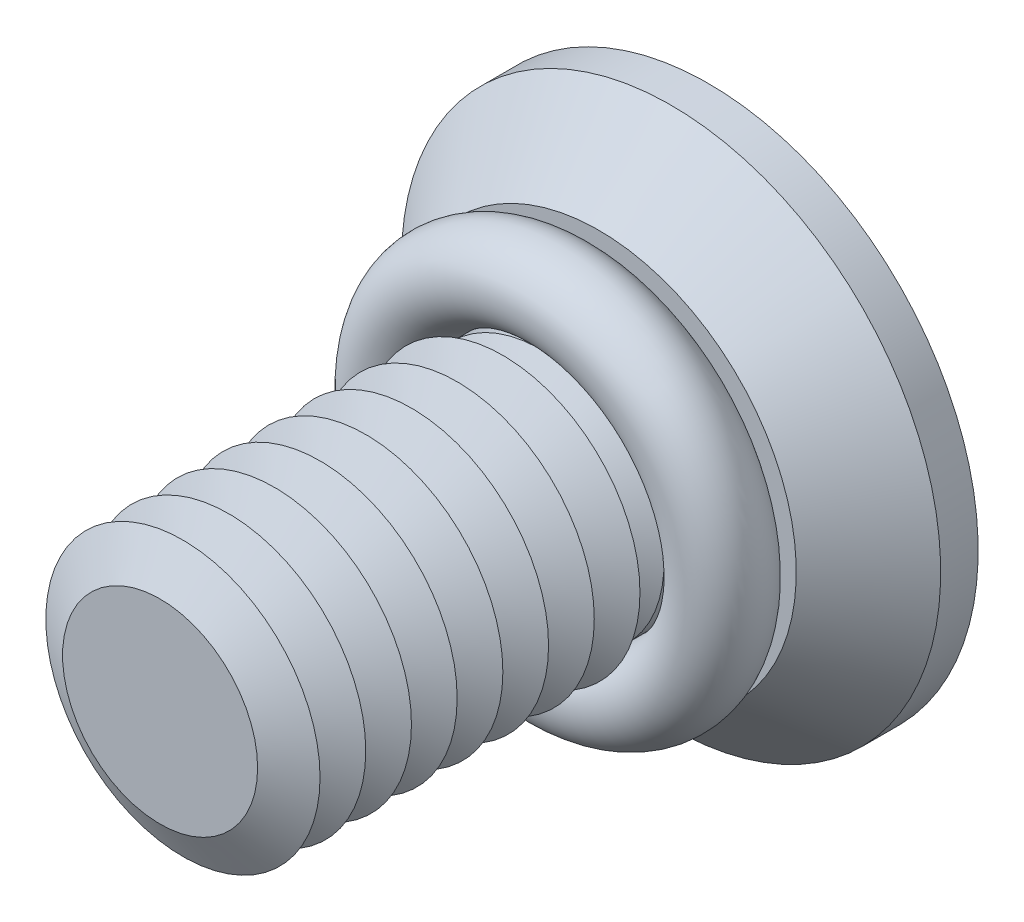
ISO-10303-21;
HEADER;
FILE_DESCRIPTION(('STEP AP214'),'2;1');
FILE_NAME('part.step','',(''),(''),'','','');
FILE_SCHEMA(('AUTOMOTIVE_DESIGN { 1 0 10303 214 1 1 1 1 }'));
ENDSEC;
DATA;
#1=APPLICATION_CONTEXT('core data for automotive mechanical design processes');
#2=APPLICATION_PROTOCOL_DEFINITION('international standard','automotive_design',2000,#1);
#3=PRODUCT_CONTEXT('',#1,'mechanical');
#4=PRODUCT('Part','Part','',(#3));
#5=PRODUCT_RELATED_PRODUCT_CATEGORY('part','',(#4));
#6=PRODUCT_DEFINITION_FORMATION('','',#4);
#7=PRODUCT_DEFINITION_CONTEXT('part definition',#1,'design');
#8=PRODUCT_DEFINITION('design','',#6,#7);
#9=PRODUCT_DEFINITION_SHAPE('','',#8);
#10=(LENGTH_UNIT() NAMED_UNIT(*) SI_UNIT(.MILLI.,.METRE.));
#11=(NAMED_UNIT(*) PLANE_ANGLE_UNIT() SI_UNIT($,.RADIAN.));
#12=(NAMED_UNIT(*) SI_UNIT($,.STERADIAN.) SOLID_ANGLE_UNIT());
#13=UNCERTAINTY_MEASURE_WITH_UNIT(LENGTH_MEASURE(1.E-05),#10,'distance_accuracy_value','');
#14=(GEOMETRIC_REPRESENTATION_CONTEXT(3) GLOBAL_UNCERTAINTY_ASSIGNED_CONTEXT((#13)) GLOBAL_UNIT_ASSIGNED_CONTEXT((#10,
#11,#12)) REPRESENTATION_CONTEXT('',''));
#15=CARTESIAN_POINT('',(0.,0.,0.));
#16=DIRECTION('',(0.,0.,1.));
#17=DIRECTION('',(1.,0.,0.));
#18=AXIS2_PLACEMENT_3D('',#15,#16,#17);
#19=CARTESIAN_POINT('',(0.,0.,3.30000000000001));
#20=DIRECTION('',(0.,0.,1.));
#21=DIRECTION('',(1.,0.,0.));
#22=AXIS2_PLACEMENT_3D('',#19,#20,#21);
#23=TOROIDAL_SURFACE('',#22,3.6,0.9);
#24=CARTESIAN_POINT('',(0.,3.6,3.30000000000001));
#25=DIRECTION('',(1.,0.,0.));
#26=DIRECTION('',(0.,0.,-1.));
#27=AXIS2_PLACEMENT_3D('',#24,#25,#26);
#28=CIRCLE('',#27,0.9);
#29=CARTESIAN_POINT('',(0.,4.5,3.30000000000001));
#30=VERTEX_POINT('',#29);
#31=EDGE_CURVE('P0_E10',#30,#30,#28,.T.);
#32=CARTESIAN_POINT('',(0.,0.,3.30000000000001));
#33=DIRECTION('',(0.,0.,1.));
#34=DIRECTION('',(1.,0.,0.));
#35=AXIS2_PLACEMENT_3D('',#32,#33,#34);
#36=CIRCLE('',#35,4.5);
#37=EDGE_CURVE('',#30,#30,#36,.T.);
#38=ORIENTED_EDGE('',*,*,#31,.F.);
#39=ORIENTED_EDGE('',*,*,#31,.T.);
#40=ORIENTED_EDGE('',*,*,#37,.T.);
#41=ORIENTED_EDGE('',*,*,#37,.F.);
#42=EDGE_LOOP('',(#38,#40,#39,#41));
#43=FACE_BOUND('',#42,.T.);
#44=ADVANCED_FACE('P0_F14',(#43),#23,.T.);
#45=CLOSED_SHELL('',(#44));
#46=MANIFOLD_SOLID_BREP('P0_B1',#45);
#47=CARTESIAN_POINT('',(0.,0.,7.));
#48=DIRECTION('',(0.,0.,-1.));
#49=DIRECTION('',(-1.,0.,0.));
#50=AXIS2_PLACEMENT_3D('',#47,#48,#49);
#51=CONICAL_SURFACE('',#50,2.13397459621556,1.0471975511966);
#52=CARTESIAN_POINT('',(0.,0.,6.5));
#53=DIRECTION('',(0.,0.,1.));
#54=DIRECTION('',(1.,0.,0.));
#55=AXIS2_PLACEMENT_3D('',#52,#53,#54);
#56=CIRCLE('',#55,3.);
#57=CARTESIAN_POINT('',(3.,0.,6.5));
#58=VERTEX_POINT('',#57);
#59=EDGE_CURVE('P1_E324',#58,#58,#56,.T.);
#60=ORIENTED_EDGE('',*,*,#59,.T.);
#61=EDGE_LOOP('',(#60));
#62=FACE_BOUND('',#61,.T.);
#63=CARTESIAN_POINT('',(0.,0.,7.));
#64=DIRECTION('',(0.,0.,1.));
#65=DIRECTION('',(1.,0.,0.));
#66=AXIS2_PLACEMENT_3D('',#63,#64,#65);
#67=CIRCLE('',#66,2.13397459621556);
#68=CARTESIAN_POINT('',(2.13397459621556,0.,7.));
#69=VERTEX_POINT('',#68);
#70=EDGE_CURVE('P1_E321',#69,#69,#67,.T.);
#71=ORIENTED_EDGE('',*,*,#70,.F.);
#72=EDGE_LOOP('',(#71));
#73=FACE_BOUND('',#72,.T.);
#74=ADVANCED_FACE('P1_F15',(#62,#73),#51,.T.);
#75=CARTESIAN_POINT('',(0.,0.,7.5));
#76=DIRECTION('',(0.,0.,1.));
#77=DIRECTION('',(1.,0.,0.));
#78=AXIS2_PLACEMENT_3D('',#75,#76,#77);
#79=CONICAL_SURFACE('',#78,3.,1.0471975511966);
#80=ORIENTED_EDGE('',*,*,#70,.T.);
#81=EDGE_LOOP('',(#80));
#82=FACE_BOUND('',#81,.T.);
#83=CARTESIAN_POINT('',(0.,0.,7.5));
#84=DIRECTION('',(0.,0.,1.));
#85=DIRECTION('',(1.,0.,0.));
#86=AXIS2_PLACEMENT_3D('',#83,#84,#85);
#87=CIRCLE('',#86,3.);
#88=CARTESIAN_POINT('',(3.,0.,7.5));
#89=VERTEX_POINT('',#88);
#90=EDGE_CURVE('P1_E318',#89,#89,#87,.T.);
#91=ORIENTED_EDGE('',*,*,#90,.F.);
#92=EDGE_LOOP('',(#91));
#93=FACE_BOUND('',#92,.T.);
#94=ADVANCED_FACE('P1_F245',(#82,#93),#79,.T.);
#95=CARTESIAN_POINT('',(0.,0.,12.));
#96=DIRECTION('',(0.,0.,1.));
#97=DIRECTION('',(1.,0.,0.));
#98=AXIS2_PLACEMENT_3D('',#95,#96,#97);
#99=PLANE('',#98);
#100=CARTESIAN_POINT('',(0.,0.,12.));
#101=DIRECTION('',(0.,0.,1.));
#102=DIRECTION('',(1.,0.,0.));
#103=AXIS2_PLACEMENT_3D('',#100,#101,#102);
#104=CIRCLE('',#103,2.13397459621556);
#105=CARTESIAN_POINT('',(2.13397459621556,0.,12.));
#106=VERTEX_POINT('',#105);
#107=EDGE_CURVE('P1_E131',#106,#106,#104,.T.);
#108=ORIENTED_EDGE('',*,*,#107,.T.);
#109=EDGE_LOOP('',(#108));
#110=FACE_BOUND('',#109,.T.);
#111=ADVANCED_FACE('P1_F251',(#110),#99,.T.);
#112=CARTESIAN_POINT('',(0.,0.,12.));
#113=DIRECTION('',(0.,0.,-1.));
#114=DIRECTION('',(-1.,0.,0.));
#115=AXIS2_PLACEMENT_3D('',#112,#113,#114);
#116=CONICAL_SURFACE('',#115,2.13397459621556,1.0471975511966);
#117=CARTESIAN_POINT('',(0.,0.,11.5));
#118=DIRECTION('',(0.,0.,1.));
#119=DIRECTION('',(1.,0.,0.));
#120=AXIS2_PLACEMENT_3D('',#117,#118,#119);
#121=CIRCLE('',#120,3.);
#122=CARTESIAN_POINT('',(3.,0.,11.5));
#123=VERTEX_POINT('',#122);
#124=EDGE_CURVE('P1_E133',#123,#123,#121,.T.);
#125=ORIENTED_EDGE('',*,*,#124,.T.);
#126=EDGE_LOOP('',(#125));
#127=FACE_BOUND('',#126,.T.);
#128=ORIENTED_EDGE('',*,*,#107,.F.);
#129=EDGE_LOOP('',(#128));
#130=FACE_BOUND('',#129,.T.);
#131=ADVANCED_FACE('P1_F196',(#127,#130),#116,.T.);
#132=CARTESIAN_POINT('',(0.,0.,11.5));
#133=DIRECTION('',(0.,0.,1.));
#134=DIRECTION('',(1.,0.,0.));
#135=AXIS2_PLACEMENT_3D('',#132,#133,#134);
#136=CONICAL_SURFACE('',#135,3.,1.0471975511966);
#137=CARTESIAN_POINT('',(0.,0.,11.));
#138=DIRECTION('',(0.,0.,1.));
#139=DIRECTION('',(1.,0.,0.));
#140=AXIS2_PLACEMENT_3D('',#137,#138,#139);
#141=CIRCLE('',#140,2.13397459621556);
#142=CARTESIAN_POINT('',(2.13397459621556,0.,11.));
#143=VERTEX_POINT('',#142);
#144=EDGE_CURVE('P1_E297',#143,#143,#141,.T.);
#145=ORIENTED_EDGE('',*,*,#144,.T.);
#146=EDGE_LOOP('',(#145));
#147=FACE_BOUND('',#146,.T.);
#148=ORIENTED_EDGE('',*,*,#124,.F.);
#149=EDGE_LOOP('',(#148));
#150=FACE_BOUND('',#149,.T.);
#151=ADVANCED_FACE('P1_F284',(#147,#150),#136,.T.);
#152=CARTESIAN_POINT('',(0.,0.,11.));
#153=DIRECTION('',(0.,0.,-1.));
#154=DIRECTION('',(-1.,0.,0.));
#155=AXIS2_PLACEMENT_3D('',#152,#153,#154);
#156=CONICAL_SURFACE('',#155,2.13397459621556,1.0471975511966);
#157=CARTESIAN_POINT('',(0.,0.,10.5));
#158=DIRECTION('',(0.,0.,1.));
#159=DIRECTION('',(1.,0.,0.));
#160=AXIS2_PLACEMENT_3D('',#157,#158,#159);
#161=CIRCLE('',#160,3.);
#162=CARTESIAN_POINT('',(3.,0.,10.5));
#163=VERTEX_POINT('',#162);
#164=EDGE_CURVE('P1_E294',#163,#163,#161,.T.);
#165=ORIENTED_EDGE('',*,*,#164,.T.);
#166=EDGE_LOOP('',(#165));
#167=FACE_BOUND('',#166,.T.);
#168=ORIENTED_EDGE('',*,*,#144,.F.);
#169=EDGE_LOOP('',(#168));
#170=FACE_BOUND('',#169,.T.);
#171=ADVANCED_FACE('P1_F279',(#167,#170),#156,.T.);
#172=CARTESIAN_POINT('',(0.,0.,10.5));
#173=DIRECTION('',(0.,0.,1.));
#174=DIRECTION('',(1.,0.,0.));
#175=AXIS2_PLACEMENT_3D('',#172,#173,#174);
#176=CONICAL_SURFACE('',#175,3.,1.0471975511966);
#177=CARTESIAN_POINT('',(0.,0.,10.));
#178=DIRECTION('',(0.,0.,1.));
#179=DIRECTION('',(1.,0.,0.));
#180=AXIS2_PLACEMENT_3D('',#177,#178,#179);
#181=CIRCLE('',#180,2.13397459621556);
#182=CARTESIAN_POINT('',(2.13397459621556,0.,10.));
#183=VERTEX_POINT('',#182);
#184=EDGE_CURVE('P1_E301',#183,#183,#181,.T.);
#185=ORIENTED_EDGE('',*,*,#184,.T.);
#186=EDGE_LOOP('',(#185));
#187=FACE_BOUND('',#186,.T.);
#188=ORIENTED_EDGE('',*,*,#164,.F.);
#189=EDGE_LOOP('',(#188));
#190=FACE_BOUND('',#189,.T.);
#191=ADVANCED_FACE('P1_F276',(#187,#190),#176,.T.);
#192=CARTESIAN_POINT('',(0.,0.,10.));
#193=DIRECTION('',(0.,0.,-1.));
#194=DIRECTION('',(-1.,0.,0.));
#195=AXIS2_PLACEMENT_3D('',#192,#193,#194);
#196=CONICAL_SURFACE('',#195,2.13397459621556,1.0471975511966);
#197=CARTESIAN_POINT('',(0.,0.,9.5));
#198=DIRECTION('',(0.,0.,1.));
#199=DIRECTION('',(1.,0.,0.));
#200=AXIS2_PLACEMENT_3D('',#197,#198,#199);
#201=CIRCLE('',#200,3.);
#202=CARTESIAN_POINT('',(3.,0.,9.5));
#203=VERTEX_POINT('',#202);
#204=EDGE_CURVE('P1_E306',#203,#203,#201,.T.);
#205=ORIENTED_EDGE('',*,*,#204,.T.);
#206=EDGE_LOOP('',(#205));
#207=FACE_BOUND('',#206,.T.);
#208=ORIENTED_EDGE('',*,*,#184,.F.);
#209=EDGE_LOOP('',(#208));
#210=FACE_BOUND('',#209,.T.);
#211=ADVANCED_FACE('P1_F271',(#207,#210),#196,.T.);
#212=CARTESIAN_POINT('',(0.,0.,9.5));
#213=DIRECTION('',(0.,0.,1.));
#214=DIRECTION('',(1.,0.,0.));
#215=AXIS2_PLACEMENT_3D('',#212,#213,#214);
#216=CONICAL_SURFACE('',#215,3.,1.0471975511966);
#217=CARTESIAN_POINT('',(0.,0.,9.));
#218=DIRECTION('',(0.,0.,1.));
#219=DIRECTION('',(1.,0.,0.));
#220=AXIS2_PLACEMENT_3D('',#217,#218,#219);
#221=CIRCLE('',#220,2.13397459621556);
#222=CARTESIAN_POINT('',(2.13397459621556,0.,9.));
#223=VERTEX_POINT('',#222);
#224=EDGE_CURVE('P1_E309',#223,#223,#221,.T.);
#225=ORIENTED_EDGE('',*,*,#224,.T.);
#226=EDGE_LOOP('',(#225));
#227=FACE_BOUND('',#226,.T.);
#228=ORIENTED_EDGE('',*,*,#204,.F.);
#229=EDGE_LOOP('',(#228));
#230=FACE_BOUND('',#229,.T.);
#231=ADVANCED_FACE('P1_F268',(#227,#230),#216,.T.);
#232=CARTESIAN_POINT('',(0.,0.,9.));
#233=DIRECTION('',(0.,0.,-1.));
#234=DIRECTION('',(-1.,0.,0.));
#235=AXIS2_PLACEMENT_3D('',#232,#233,#234);
#236=CONICAL_SURFACE('',#235,2.13397459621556,1.0471975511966);
#237=CARTESIAN_POINT('',(0.,0.,8.5));
#238=DIRECTION('',(0.,0.,1.));
#239=DIRECTION('',(1.,0.,0.));
#240=AXIS2_PLACEMENT_3D('',#237,#238,#239);
#241=CIRCLE('',#240,3.);
#242=CARTESIAN_POINT('',(3.,0.,8.5));
#243=VERTEX_POINT('',#242);
#244=EDGE_CURVE('P1_E312',#243,#243,#241,.T.);
#245=ORIENTED_EDGE('',*,*,#244,.T.);
#246=EDGE_LOOP('',(#245));
#247=FACE_BOUND('',#246,.T.);
#248=ORIENTED_EDGE('',*,*,#224,.F.);
#249=EDGE_LOOP('',(#248));
#250=FACE_BOUND('',#249,.T.);
#251=ADVANCED_FACE('P1_F262',(#247,#250),#236,.T.);
#252=CARTESIAN_POINT('',(0.,0.,8.5));
#253=DIRECTION('',(0.,0.,1.));
#254=DIRECTION('',(1.,0.,0.));
#255=AXIS2_PLACEMENT_3D('',#252,#253,#254);
#256=CONICAL_SURFACE('',#255,3.,1.0471975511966);
#257=CARTESIAN_POINT('',(0.,0.,8.));
#258=DIRECTION('',(0.,0.,1.));
#259=DIRECTION('',(1.,0.,0.));
#260=AXIS2_PLACEMENT_3D('',#257,#258,#259);
#261=CIRCLE('',#260,2.13397459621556);
#262=CARTESIAN_POINT('',(2.13397459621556,0.,8.));
#263=VERTEX_POINT('',#262);
#264=EDGE_CURVE('P1_E315',#263,#263,#261,.T.);
#265=ORIENTED_EDGE('',*,*,#264,.T.);
#266=EDGE_LOOP('',(#265));
#267=FACE_BOUND('',#266,.T.);
#268=ORIENTED_EDGE('',*,*,#244,.F.);
#269=EDGE_LOOP('',(#268));
#270=FACE_BOUND('',#269,.T.);
#271=ADVANCED_FACE('P1_F258',(#267,#270),#256,.T.);
#272=CARTESIAN_POINT('',(0.,0.,8.));
#273=DIRECTION('',(0.,0.,-1.));
#274=DIRECTION('',(-1.,0.,0.));
#275=AXIS2_PLACEMENT_3D('',#272,#273,#274);
#276=CONICAL_SURFACE('',#275,2.13397459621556,1.0471975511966);
#277=ORIENTED_EDGE('',*,*,#90,.T.);
#278=EDGE_LOOP('',(#277));
#279=FACE_BOUND('',#278,.T.);
#280=ORIENTED_EDGE('',*,*,#264,.F.);
#281=EDGE_LOOP('',(#280));
#282=FACE_BOUND('',#281,.T.);
#283=ADVANCED_FACE('P1_F261',(#279,#282),#276,.T.);
#284=CARTESIAN_POINT('',(0.,0.,6.));
#285=DIRECTION('',(0.,0.,-1.));
#286=DIRECTION('',(-1.,0.,0.));
#287=AXIS2_PLACEMENT_3D('',#284,#285,#286);
#288=CONICAL_SURFACE('',#287,2.13397459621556,1.0471975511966);
#289=CARTESIAN_POINT('',(0.,0.,5.5));
#290=DIRECTION('',(0.,0.,1.));
#291=DIRECTION('',(1.,0.,0.));
#292=AXIS2_PLACEMENT_3D('',#289,#290,#291);
#293=CIRCLE('',#292,3.);
#294=CARTESIAN_POINT('',(3.,0.,5.5));
#295=VERTEX_POINT('',#294);
#296=EDGE_CURVE('P1_E329',#295,#295,#293,.T.);
#297=ORIENTED_EDGE('',*,*,#296,.T.);
#298=EDGE_LOOP('',(#297));
#299=FACE_BOUND('',#298,.T.);
#300=CARTESIAN_POINT('',(0.,0.,6.));
#301=DIRECTION('',(0.,0.,1.));
#302=DIRECTION('',(1.,0.,0.));
#303=AXIS2_PLACEMENT_3D('',#300,#301,#302);
#304=CIRCLE('',#303,2.13397459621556);
#305=CARTESIAN_POINT('',(2.13397459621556,0.,6.));
#306=VERTEX_POINT('',#305);
#307=EDGE_CURVE('P1_E326',#306,#306,#304,.T.);
#308=ORIENTED_EDGE('',*,*,#307,.F.);
#309=EDGE_LOOP('',(#308));
#310=FACE_BOUND('',#309,.T.);
#311=ADVANCED_FACE('P1_F266',(#299,#310),#288,.T.);
#312=CARTESIAN_POINT('',(0.,0.,6.5));
#313=DIRECTION('',(0.,0.,1.));
#314=DIRECTION('',(1.,0.,0.));
#315=AXIS2_PLACEMENT_3D('',#312,#313,#314);
#316=CONICAL_SURFACE('',#315,3.,1.0471975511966);
#317=ORIENTED_EDGE('',*,*,#307,.T.);
#318=EDGE_LOOP('',(#317));
#319=FACE_BOUND('',#318,.T.);
#320=ORIENTED_EDGE('',*,*,#59,.F.);
#321=EDGE_LOOP('',(#320));
#322=FACE_BOUND('',#321,.T.);
#323=ADVANCED_FACE('P1_F444',(#319,#322),#316,.T.);
#324=CARTESIAN_POINT('',(0.,0.,5.));
#325=DIRECTION('',(0.,0.,-1.));
#326=DIRECTION('',(-1.,0.,0.));
#327=AXIS2_PLACEMENT_3D('',#324,#325,#326);
#328=CONICAL_SURFACE('',#327,2.13397459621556,1.0471975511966);
#329=CARTESIAN_POINT('',(0.,0.,4.5));
#330=DIRECTION('',(0.,0.,1.));
#331=DIRECTION('',(1.,0.,0.));
#332=AXIS2_PLACEMENT_3D('',#329,#330,#331);
#333=CIRCLE('',#332,3.);
#334=CARTESIAN_POINT('',(3.,0.,4.5));
#335=VERTEX_POINT('',#334);
#336=EDGE_CURVE('P1_E335',#335,#335,#333,.T.);
#337=ORIENTED_EDGE('',*,*,#336,.T.);
#338=EDGE_LOOP('',(#337));
#339=FACE_BOUND('',#338,.T.);
#340=CARTESIAN_POINT('',(0.,0.,5.));
#341=DIRECTION('',(0.,0.,1.));
#342=DIRECTION('',(1.,0.,0.));
#343=AXIS2_PLACEMENT_3D('',#340,#341,#342);
#344=CIRCLE('',#343,2.13397459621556);
#345=CARTESIAN_POINT('',(2.13397459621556,0.,5.));
#346=VERTEX_POINT('',#345);
#347=EDGE_CURVE('P1_E332',#346,#346,#344,.T.);
#348=ORIENTED_EDGE('',*,*,#347,.F.);
#349=EDGE_LOOP('',(#348));
#350=FACE_BOUND('',#349,.T.);
#351=ADVANCED_FACE('P1_F454',(#339,#350),#328,.T.);
#352=CARTESIAN_POINT('',(0.,0.,5.5));
#353=DIRECTION('',(0.,0.,1.));
#354=DIRECTION('',(1.,0.,0.));
#355=AXIS2_PLACEMENT_3D('',#352,#353,#354);
#356=CONICAL_SURFACE('',#355,3.,1.0471975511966);
#357=ORIENTED_EDGE('',*,*,#347,.T.);
#358=EDGE_LOOP('',(#357));
#359=FACE_BOUND('',#358,.T.);
#360=ORIENTED_EDGE('',*,*,#296,.F.);
#361=EDGE_LOOP('',(#360));
#362=FACE_BOUND('',#361,.T.);
#363=ADVANCED_FACE('P1_F348',(#359,#362),#356,.T.);
#364=CARTESIAN_POINT('',(0.,0.,4.));
#365=DIRECTION('',(0.,0.,-1.));
#366=DIRECTION('',(-1.,0.,0.));
#367=AXIS2_PLACEMENT_3D('',#364,#365,#366);
#368=CONICAL_SURFACE('',#367,2.13397459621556,1.0471975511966);
#369=CARTESIAN_POINT('',(0.,0.,4.));
#370=DIRECTION('',(0.,0.,1.));
#371=DIRECTION('',(1.,0.,0.));
#372=AXIS2_PLACEMENT_3D('',#369,#370,#371);
#373=CIRCLE('',#372,2.13397459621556);
#374=CARTESIAN_POINT('',(2.13397459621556,0.,4.));
#375=VERTEX_POINT('',#374);
#376=EDGE_CURVE('P1_E338',#375,#375,#373,.T.);
#377=ORIENTED_EDGE('',*,*,#376,.F.);
#378=EDGE_LOOP('',(#377));
#379=FACE_BOUND('',#378,.T.);
#380=CARTESIAN_POINT('',(0.,0.,3.67320508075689));
#381=DIRECTION('',(0.,0.,-1.));
#382=DIRECTION('',(-1.,0.,0.));
#383=AXIS2_PLACEMENT_3D('',#380,#381,#382);
#384=CIRCLE('',#383,2.7);
#385=CARTESIAN_POINT('',(-2.7,0.,3.67320508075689));
#386=VERTEX_POINT('',#385);
#387=EDGE_CURVE('P1_E19',#386,#386,#384,.F.);
#388=ORIENTED_EDGE('',*,*,#387,.T.);
#389=EDGE_LOOP('',(#388));
#390=FACE_BOUND('',#389,.T.);
#391=ADVANCED_FACE('P1_F345',(#379,#390),#368,.T.);
#392=CARTESIAN_POINT('',(0.,0.,4.5));
#393=DIRECTION('',(0.,0.,1.));
#394=DIRECTION('',(1.,0.,0.));
#395=AXIS2_PLACEMENT_3D('',#392,#393,#394);
#396=CONICAL_SURFACE('',#395,3.,1.0471975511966);
#397=ORIENTED_EDGE('',*,*,#376,.T.);
#398=EDGE_LOOP('',(#397));
#399=FACE_BOUND('',#398,.T.);
#400=ORIENTED_EDGE('',*,*,#336,.F.);
#401=EDGE_LOOP('',(#400));
#402=FACE_BOUND('',#401,.T.);
#403=ADVANCED_FACE('P1_F342',(#399,#402),#396,.T.);
#404=CARTESIAN_POINT('',(0.,0.,2.5));
#405=DIRECTION('',(0.,0.,-1.));
#406=DIRECTION('',(-1.,0.,0.));
#407=AXIS2_PLACEMENT_3D('',#404,#405,#406);
#408=CONICAL_SURFACE('',#407,2.,1.0471975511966);
#409=CARTESIAN_POINT('',(0.,0.,3.65470053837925));
#410=VERTEX_POINT('',#409);
#411=VERTEX_LOOP('',#410);
#412=FACE_BOUND('',#411,.T.);
#413=CARTESIAN_POINT('',(0.,0.,2.5));
#414=DIRECTION('',(0.,0.,-1.));
#415=DIRECTION('',(-1.,0.,0.));
#416=AXIS2_PLACEMENT_3D('',#413,#414,#415);
#417=CIRCLE('',#416,2.);
#418=CARTESIAN_POINT('',(-2.,0.,2.5));
#419=VERTEX_POINT('',#418);
#420=CARTESIAN_POINT('',(-1.,1.73205080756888,2.5));
#421=VERTEX_POINT('',#420);
#422=EDGE_CURVE('P1_E117',#419,#421,#417,.T.);
#423=ORIENTED_EDGE('',*,*,#422,.T.);
#424=CARTESIAN_POINT('',(0.,0.,2.5));
#425=DIRECTION('',(0.,0.,-1.));
#426=DIRECTION('',(-1.,0.,0.));
#427=AXIS2_PLACEMENT_3D('',#424,#425,#426);
#428=CIRCLE('',#427,2.);
#429=CARTESIAN_POINT('',(1.,1.73205080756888,2.5));
#430=VERTEX_POINT('',#429);
#431=EDGE_CURVE('P1_E24',#421,#430,#428,.T.);
#432=ORIENTED_EDGE('',*,*,#431,.T.);
#433=CARTESIAN_POINT('',(2.,0.,2.5));
#434=VERTEX_POINT('',#433);
#435=EDGE_CURVE('P1_E687',#430,#434,#428,.T.);
#436=ORIENTED_EDGE('',*,*,#435,.T.);
#437=CARTESIAN_POINT('',(1.,-1.73205080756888,2.5));
#438=VERTEX_POINT('',#437);
#439=EDGE_CURVE('P1_E680',#434,#438,#428,.T.);
#440=ORIENTED_EDGE('',*,*,#439,.T.);
#441=CARTESIAN_POINT('',(-1.,-1.73205080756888,2.5));
#442=VERTEX_POINT('',#441);
#443=EDGE_CURVE('P1_E182',#438,#442,#428,.T.);
#444=ORIENTED_EDGE('',*,*,#443,.T.);
#445=EDGE_CURVE('P1_E179',#442,#419,#428,.T.);
#446=ORIENTED_EDGE('',*,*,#445,.T.);
#447=EDGE_LOOP('',(#423,#432,#436,#440,#444,#446));
#448=FACE_BOUND('',#447,.T.);
#449=ADVANCED_FACE('P1_F198',(#412,#448),#408,.F.);
#450=CARTESIAN_POINT('',(0.,0.,2.5));
#451=DIRECTION('',(0.,0.,-1.));
#452=DIRECTION('',(-1.,0.,0.));
#453=AXIS2_PLACEMENT_3D('',#450,#451,#452);
#454=PLANE('',#453);
#455=ORIENTED_EDGE('',*,*,#443,.F.);
#456=DIRECTION('',(-0.866025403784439,-0.5,0.));
#457=VECTOR('',#456,1.);
#458=CARTESIAN_POINT('',(2.,-1.15470053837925,2.5));
#459=LINE('',#458,#457);
#460=CARTESIAN_POINT('',(0.,-2.3094010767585,2.5));
#461=VERTEX_POINT('',#460);
#462=EDGE_CURVE('P1_E696',#438,#461,#459,.T.);
#463=ORIENTED_EDGE('',*,*,#462,.T.);
#464=DIRECTION('',(-0.866025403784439,0.5,0.));
#465=VECTOR('',#464,1.);
#466=CARTESIAN_POINT('',(0.,-2.3094010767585,2.5));
#467=LINE('',#466,#465);
#468=EDGE_CURVE('P1_E703',#461,#442,#467,.T.);
#469=ORIENTED_EDGE('',*,*,#468,.T.);
#470=EDGE_LOOP('',(#455,#463,#469));
#471=FACE_BOUND('',#470,.T.);
#472=ADVANCED_FACE('P1_F496',(#471),#454,.T.);
#473=ORIENTED_EDGE('',*,*,#445,.F.);
#474=CARTESIAN_POINT('',(-2.,-1.15470053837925,2.5));
#475=VERTEX_POINT('',#474);
#476=EDGE_CURVE('P1_E706',#442,#475,#467,.T.);
#477=ORIENTED_EDGE('',*,*,#476,.T.);
#478=DIRECTION('',(0.,1.,0.));
#479=VECTOR('',#478,1.);
#480=CARTESIAN_POINT('',(-2.,-1.15470053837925,2.5));
#481=LINE('',#480,#479);
#482=EDGE_CURVE('P1_E123',#475,#419,#481,.T.);
#483=ORIENTED_EDGE('',*,*,#482,.T.);
#484=EDGE_LOOP('',(#473,#477,#483));
#485=FACE_BOUND('',#484,.T.);
#486=ADVANCED_FACE('P1_F231',(#485),#454,.T.);
#487=ORIENTED_EDGE('',*,*,#422,.F.);
#488=CARTESIAN_POINT('',(-2.,1.15470053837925,2.5));
#489=VERTEX_POINT('',#488);
#490=EDGE_CURVE('P1_E708',#419,#489,#481,.T.);
#491=ORIENTED_EDGE('',*,*,#490,.T.);
#492=DIRECTION('',(0.866025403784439,0.5,0.));
#493=VECTOR('',#492,1.);
#494=CARTESIAN_POINT('',(-2.,1.15470053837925,2.5));
#495=LINE('',#494,#493);
#496=EDGE_CURVE('P1_E711',#489,#421,#495,.T.);
#497=ORIENTED_EDGE('',*,*,#496,.T.);
#498=EDGE_LOOP('',(#487,#491,#497));
#499=FACE_BOUND('',#498,.T.);
#500=ADVANCED_FACE('P1_F514',(#499),#454,.T.);
#501=ORIENTED_EDGE('',*,*,#431,.F.);
#502=CARTESIAN_POINT('',(0.,2.3094010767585,2.5));
#503=VERTEX_POINT('',#502);
#504=EDGE_CURVE('P1_E710',#421,#503,#495,.T.);
#505=ORIENTED_EDGE('',*,*,#504,.T.);
#506=DIRECTION('',(0.866025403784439,-0.5,0.));
#507=VECTOR('',#506,1.);
#508=CARTESIAN_POINT('',(0.,2.3094010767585,2.5));
#509=LINE('',#508,#507);
#510=EDGE_CURVE('P1_E161',#503,#430,#509,.T.);
#511=ORIENTED_EDGE('',*,*,#510,.T.);
#512=EDGE_LOOP('',(#501,#505,#511));
#513=FACE_BOUND('',#512,.T.);
#514=ADVANCED_FACE('P1_F523',(#513),#454,.T.);
#515=ORIENTED_EDGE('',*,*,#435,.F.);
#516=CARTESIAN_POINT('',(2.,1.15470053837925,2.5));
#517=VERTEX_POINT('',#516);
#518=EDGE_CURVE('P1_E695',#430,#517,#509,.T.);
#519=ORIENTED_EDGE('',*,*,#518,.T.);
#520=DIRECTION('',(0.,-1.,0.));
#521=VECTOR('',#520,1.);
#522=CARTESIAN_POINT('',(2.,1.15470053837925,2.5));
#523=LINE('',#522,#521);
#524=EDGE_CURVE('P1_E690',#517,#434,#523,.T.);
#525=ORIENTED_EDGE('',*,*,#524,.T.);
#526=EDGE_LOOP('',(#515,#519,#525));
#527=FACE_BOUND('',#526,.T.);
#528=ADVANCED_FACE('P1_F533',(#527),#454,.T.);
#529=ORIENTED_EDGE('',*,*,#439,.F.);
#530=CARTESIAN_POINT('',(2.,-1.15470053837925,2.5));
#531=VERTEX_POINT('',#530);
#532=EDGE_CURVE('P1_E682',#434,#531,#523,.T.);
#533=ORIENTED_EDGE('',*,*,#532,.T.);
#534=EDGE_CURVE('P1_E125',#531,#438,#459,.T.);
#535=ORIENTED_EDGE('',*,*,#534,.T.);
#536=EDGE_LOOP('',(#529,#533,#535));
#537=FACE_BOUND('',#536,.T.);
#538=ADVANCED_FACE('P1_F229',(#537),#454,.T.);
#539=CARTESIAN_POINT('',(2.,-1.15470053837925,2.5));
#540=DIRECTION('',(0.5,-0.866025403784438,0.));
#541=DIRECTION('',(0.866025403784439,0.5,0.));
#542=AXIS2_PLACEMENT_3D('',#539,#540,#541);
#543=PLANE('',#542);
#544=DIRECTION('',(0.,0.,-1.));
#545=VECTOR('',#544,1.);
#546=CARTESIAN_POINT('',(2.,-1.15470053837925,2.5));
#547=LINE('',#546,#545);
#548=CARTESIAN_POINT('',(2.,-1.15470053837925,0.));
#549=VERTEX_POINT('',#548);
#550=EDGE_CURVE('P1_E164',#531,#549,#547,.T.);
#551=ORIENTED_EDGE('',*,*,#550,.T.);
#552=CARTESIAN_POINT('',(2.0002,-1.15458506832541,-3.09424280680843E-05));
#553=CARTESIAN_POINT('',(1.91712847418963,-1.20254643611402,0.0128270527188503));
#554=CARTESIAN_POINT('',(1.83390630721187,-1.25059477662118,0.0245000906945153));
#555=CARTESIAN_POINT('',(1.66716800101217,-1.3468611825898,0.0450086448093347));
#556=CARTESIAN_POINT('',(1.58365175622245,-1.39507930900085,0.0538430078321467));
#557=CARTESIAN_POINT('',(1.41683177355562,-1.49139287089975,0.0681583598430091));
#558=CARTESIAN_POINT('',(1.33352916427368,-1.53948765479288,0.0736564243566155));
#559=CARTESIAN_POINT('',(1.1668176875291,-1.63573857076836,0.0810287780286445));
#560=CARTESIAN_POINT('',(1.08340884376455,-1.68389468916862,0.0829037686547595));
#561=CARTESIAN_POINT('',(0.916591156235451,-1.78020692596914,0.0829037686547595));
#562=CARTESIAN_POINT('',(0.833182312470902,-1.82836304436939,0.0810287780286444));
#563=CARTESIAN_POINT('',(0.666470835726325,-1.92461396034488,0.0736564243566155));
#564=CARTESIAN_POINT('',(0.583168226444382,-1.972708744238,0.068158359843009));
#565=CARTESIAN_POINT('',(0.416348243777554,-2.06902230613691,0.0538430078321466));
#566=CARTESIAN_POINT('',(0.332831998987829,-2.11724043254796,0.0450086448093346));
#567=CARTESIAN_POINT('',(0.16609369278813,-2.21350683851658,0.0245000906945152));
#568=CARTESIAN_POINT('',(0.0828715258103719,-2.26155517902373,0.0128270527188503));
#569=CARTESIAN_POINT('',(-0.000199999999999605,-2.30951654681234,-3.09424280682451E-05));
#570=B_SPLINE_CURVE_WITH_KNOTS('',3,(#552,#553,#554,#555,#556,#557,#558,#559,#560,#561,#562,
#563,#564,#565,#566,#567,#568,#569),.UNSPECIFIED.,.F.,.F.,(4,2,2,2,2,2,2,2,4),(0.,
0.290357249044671,0.580832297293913,0.869807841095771,1.15872743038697,1.44764701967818,
1.73662256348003,2.02709761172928,2.31745486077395),.UNSPECIFIED.);
#571=CARTESIAN_POINT('',(0.,-2.3094010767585,0.));
#572=VERTEX_POINT('',#571);
#573=EDGE_CURVE('P1_E118',#549,#572,#570,.T.);
#574=ORIENTED_EDGE('',*,*,#573,.T.);
#575=DIRECTION('',(0.,0.,-1.));
#576=VECTOR('',#575,1.);
#577=CARTESIAN_POINT('',(0.,-2.3094010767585,2.5));
#578=LINE('',#577,#576);
#579=EDGE_CURVE('P1_E116',#461,#572,#578,.T.);
#580=ORIENTED_EDGE('',*,*,#579,.F.);
#581=ORIENTED_EDGE('',*,*,#462,.F.);
#582=ORIENTED_EDGE('',*,*,#534,.F.);
#583=EDGE_LOOP('',(#551,#574,#580,#581,#582));
#584=FACE_BOUND('',#583,.T.);
#585=ADVANCED_FACE('P1_F226',(#584),#543,.F.);
#586=CARTESIAN_POINT('',(0.,-2.3094010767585,2.5));
#587=DIRECTION('',(-0.5,-0.866025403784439,0.));
#588=DIRECTION('',(0.866025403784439,-0.5,0.));
#589=AXIS2_PLACEMENT_3D('',#586,#587,#588);
#590=PLANE('',#589);
#591=ORIENTED_EDGE('',*,*,#579,.T.);
#592=CARTESIAN_POINT('',(0.000200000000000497,-2.30951654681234,-3.09424280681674E-05));
#593=CARTESIAN_POINT('',(-0.0828715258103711,-2.26155517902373,0.0128270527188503));
#594=CARTESIAN_POINT('',(-0.166093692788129,-2.21350683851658,0.0245000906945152));
#595=CARTESIAN_POINT('',(-0.332831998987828,-2.11724043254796,0.0450086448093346));
#596=CARTESIAN_POINT('',(-0.416348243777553,-2.06902230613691,0.0538430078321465));
#597=CARTESIAN_POINT('',(-0.583168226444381,-1.972708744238,0.068158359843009));
#598=CARTESIAN_POINT('',(-0.666470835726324,-1.92461396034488,0.0736564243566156));
#599=CARTESIAN_POINT('',(-0.833182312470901,-1.82836304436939,0.0810287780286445));
#600=CARTESIAN_POINT('',(-0.916591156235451,-1.78020692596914,0.0829037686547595));
#601=CARTESIAN_POINT('',(-1.08340884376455,-1.68389468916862,0.0829037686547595));
#602=CARTESIAN_POINT('',(-1.1668176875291,-1.63573857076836,0.0810287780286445));
#603=CARTESIAN_POINT('',(-1.33352916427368,-1.53948765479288,0.0736564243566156));
#604=CARTESIAN_POINT('',(-1.41683177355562,-1.49139287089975,0.0681583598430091));
#605=CARTESIAN_POINT('',(-1.58365175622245,-1.39507930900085,0.0538430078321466));
#606=CARTESIAN_POINT('',(-1.66716800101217,-1.3468611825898,0.0450086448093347));
#607=CARTESIAN_POINT('',(-1.83390630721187,-1.25059477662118,0.0245000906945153));
#608=CARTESIAN_POINT('',(-1.91712847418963,-1.20254643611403,0.0128270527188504));
#609=CARTESIAN_POINT('',(-2.0002,-1.15458506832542,-3.09424280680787E-05));
#610=B_SPLINE_CURVE_WITH_KNOTS('',3,(#592,#593,#594,#595,#596,#597,#598,#599,#600,#601,#602,
#603,#604,#605,#606,#607,#608,#609),.UNSPECIFIED.,.F.,.F.,(4,2,2,2,2,2,2,2,4),(0.,
0.29035724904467,0.580832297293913,0.869807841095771,1.15872743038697,1.44764701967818,
1.73662256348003,2.02709761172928,2.31745486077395),.UNSPECIFIED.);
#611=CARTESIAN_POINT('',(-2.,-1.15470053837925,0.));
#612=VERTEX_POINT('',#611);
#613=EDGE_CURVE('P1_E94',#572,#612,#610,.T.);
#614=ORIENTED_EDGE('',*,*,#613,.T.);
#615=DIRECTION('',(0.,0.,-1.));
#616=VECTOR('',#615,1.);
#617=CARTESIAN_POINT('',(-2.,-1.15470053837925,2.5));
#618=LINE('',#617,#616);
#619=EDGE_CURVE('P1_E112',#475,#612,#618,.T.);
#620=ORIENTED_EDGE('',*,*,#619,.F.);
#621=ORIENTED_EDGE('',*,*,#476,.F.);
#622=ORIENTED_EDGE('',*,*,#468,.F.);
#623=EDGE_LOOP('',(#591,#614,#620,#621,#622));
#624=FACE_BOUND('',#623,.T.);
#625=ADVANCED_FACE('P1_F110',(#624),#590,.F.);
#626=CARTESIAN_POINT('',(-2.,-1.15470053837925,2.5));
#627=DIRECTION('',(-1.,0.,0.));
#628=DIRECTION('',(0.,-1.,0.));
#629=AXIS2_PLACEMENT_3D('',#626,#627,#628);
#630=PLANE('',#629);
#631=ORIENTED_EDGE('',*,*,#619,.T.);
#632=CARTESIAN_POINT('',(-2.,-3.01440758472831,-0.350516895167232));
#633=CARTESIAN_POINT('',(-2.,-2.92409762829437,-0.330356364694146));
#634=CARTESIAN_POINT('',(-2.,-2.83373054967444,-0.310452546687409));
#635=CARTESIAN_POINT('',(-2.,-2.65285291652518,-0.271288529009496));
#636=CARTESIAN_POINT('',(-2.,-2.56234235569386,-0.252028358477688));
#637=CARTESIAN_POINT('',(-2.,-2.29037985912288,-0.195373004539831));
#638=CARTESIAN_POINT('',(-2.,-2.10868043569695,-0.159144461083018));
#639=CARTESIAN_POINT('',(-2.,-1.74597297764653,-0.0917168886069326));
#640=CARTESIAN_POINT('',(-2.,-1.5649726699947,-0.0604768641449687));
#641=CARTESIAN_POINT('',(-2.,-1.20186568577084,-0.00513826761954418));
#642=CARTESIAN_POINT('',(-2.,-1.01975924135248,0.0189617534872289));
#643=CARTESIAN_POINT('',(-2.,-0.744747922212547,0.0474098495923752));
#644=CARTESIAN_POINT('',(-2.,-0.652245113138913,0.0556328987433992));
#645=CARTESIAN_POINT('',(-2.,-0.467020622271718,0.0690059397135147));
#646=CARTESIAN_POINT('',(-2.,-0.374298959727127,0.0741561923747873));
#647=CARTESIAN_POINT('',(-2.,-0.188764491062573,0.081084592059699));
#648=CARTESIAN_POINT('',(-2.,-0.0959517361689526,0.082864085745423));
#649=CARTESIAN_POINT('',(-2.,0.0896753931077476,0.0829421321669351));
#650=CARTESIAN_POINT('',(-2.,0.182489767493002,0.0812406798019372));
#651=CARTESIAN_POINT('',(-2.,0.368369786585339,0.074451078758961));
#652=CARTESIAN_POINT('',(-2.,0.461434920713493,0.0693492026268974));
#653=CARTESIAN_POINT('',(-2.,0.647346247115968,0.0560433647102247));
#654=CARTESIAN_POINT('',(-2.,0.7401924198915,0.0478391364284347));
#655=CARTESIAN_POINT('',(-2.,1.01841374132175,0.0191822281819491));
#656=CARTESIAN_POINT('',(-2.,1.20337134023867,-0.00531018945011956));
#657=CARTESIAN_POINT('',(-2.,1.5769439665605,-0.0623620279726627));
#658=CARTESIAN_POINT('',(-2.,1.76552771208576,-0.0951161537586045));
#659=CARTESIAN_POINT('',(-2.,2.14178491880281,-0.165570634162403));
#660=CARTESIAN_POINT('',(-2.,2.32945822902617,-0.203271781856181));
#661=CARTESIAN_POINT('',(-2.,2.70417911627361,-0.281883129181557));
#662=CARTESIAN_POINT('',(-2.,2.89122649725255,-0.322794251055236));
#663=CARTESIAN_POINT('',(-2.,3.264844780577,-0.406742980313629));
#664=CARTESIAN_POINT('',(-2.,3.45141567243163,-0.449780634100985));
#665=CARTESIAN_POINT('',(-2.,3.82193813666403,-0.536781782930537));
#666=CARTESIAN_POINT('',(-2.,4.00589388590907,-0.580727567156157));
#667=CARTESIAN_POINT('',(-2.,4.37356350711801,-0.669635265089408));
#668=CARTESIAN_POINT('',(-2.,4.55727737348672,-0.714597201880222));
#669=CARTESIAN_POINT('',(-2.,4.9242660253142,-0.805198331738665));
#670=CARTESIAN_POINT('',(-2.,5.10754106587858,-0.850836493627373));
#671=CARTESIAN_POINT('',(-2.,5.47394280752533,-0.942676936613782));
#672=CARTESIAN_POINT('',(-2.,5.65706951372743,-0.988879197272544));
#673=CARTESIAN_POINT('',(-2.,5.8401458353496,-1.03527803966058));
#674=B_SPLINE_CURVE_WITH_KNOTS('',3,(#632,#633,#634,#635,#636,#637,#638,#639,#640,#641,#642,
#643,#644,#645,#646,#647,#648,#649,#650,#651,#652,#653,#654,#655,#656,#657,#658,#659,#660,#661,
#662,#663,#664,#665,#666,#667,#668,#669,#670,#671,#672,#673),.UNSPECIFIED.,.F.,.F.,(4,2,2,2,2,2,
2,2,2,2,2,2,2,2,2,2,2,2,2,2,4),(0.,0.277597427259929,0.555207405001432,1.11099118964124,
1.6619420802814,2.21278108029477,2.49134108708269,2.76987744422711,3.04830249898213,
3.32672796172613,3.60628428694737,3.88586463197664,4.4453261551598,5.01945893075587,
5.59368386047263,6.16807437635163,6.74247743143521,7.30986991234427,7.87727529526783,
8.44388991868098,9.01048407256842),.UNSPECIFIED.);
#675=CARTESIAN_POINT('',(-2.,1.15470053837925,0.));
#676=VERTEX_POINT('',#675);
#677=EDGE_CURVE('P1_E10',#612,#676,#674,.T.);
#678=ORIENTED_EDGE('',*,*,#677,.T.);
#679=DIRECTION('',(0.,0.,-1.));
#680=VECTOR('',#679,1.);
#681=CARTESIAN_POINT('',(-2.,1.15470053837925,2.5));
#682=LINE('',#681,#680);
#683=EDGE_CURVE('P1_E124',#489,#676,#682,.T.);
#684=ORIENTED_EDGE('',*,*,#683,.F.);
#685=ORIENTED_EDGE('',*,*,#490,.F.);
#686=ORIENTED_EDGE('',*,*,#482,.F.);
#687=EDGE_LOOP('',(#631,#678,#684,#685,#686));
#688=FACE_BOUND('',#687,.T.);
#689=ADVANCED_FACE('P1_F120',(#688),#630,.F.);
#690=CARTESIAN_POINT('',(-2.,1.15470053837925,2.5));
#691=DIRECTION('',(-0.5,0.866025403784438,0.));
#692=DIRECTION('',(-0.866025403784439,-0.5,0.));
#693=AXIS2_PLACEMENT_3D('',#690,#691,#692);
#694=PLANE('',#693);
#695=ORIENTED_EDGE('',*,*,#683,.T.);
#696=CARTESIAN_POINT('',(-2.0002,1.15458506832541,-3.09424280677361E-05));
#697=CARTESIAN_POINT('',(-1.91712847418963,1.20254643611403,0.0128270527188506));
#698=CARTESIAN_POINT('',(-1.83390630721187,1.25059477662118,0.0245000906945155));
#699=CARTESIAN_POINT('',(-1.66716800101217,1.3468611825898,0.045008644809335));
#700=CARTESIAN_POINT('',(-1.58365175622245,1.39507930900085,0.0538430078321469));
#701=CARTESIAN_POINT('',(-1.41683177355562,1.49139287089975,0.0681583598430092));
#702=CARTESIAN_POINT('',(-1.33352916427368,1.53948765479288,0.0736564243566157));
#703=CARTESIAN_POINT('',(-1.1668176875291,1.63573857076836,0.0810287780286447));
#704=CARTESIAN_POINT('',(-1.08340884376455,1.68389468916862,0.0829037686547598));
#705=CARTESIAN_POINT('',(-0.916591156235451,1.78020692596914,0.0829037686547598));
#706=CARTESIAN_POINT('',(-0.833182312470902,1.82836304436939,0.0810287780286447));
#707=CARTESIAN_POINT('',(-0.666470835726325,1.92461396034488,0.0736564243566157));
#708=CARTESIAN_POINT('',(-0.583168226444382,1.972708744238,0.0681583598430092));
#709=CARTESIAN_POINT('',(-0.416348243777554,2.0690223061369,0.0538430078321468));
#710=CARTESIAN_POINT('',(-0.332831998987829,2.11724043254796,0.0450086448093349));
#711=CARTESIAN_POINT('',(-0.16609369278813,2.21350683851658,0.0245000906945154));
#712=CARTESIAN_POINT('',(-0.0828715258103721,2.26155517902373,0.0128270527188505));
#713=CARTESIAN_POINT('',(0.000199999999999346,2.30951654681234,-3.09424280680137E-05));
#714=B_SPLINE_CURVE_WITH_KNOTS('',3,(#696,#697,#698,#699,#700,#701,#702,#703,#704,#705,#706,
#707,#708,#709,#710,#711,#712,#713),.UNSPECIFIED.,.F.,.F.,(4,2,2,2,2,2,2,2,4),(0.,
0.29035724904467,0.580832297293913,0.86980784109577,1.15872743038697,1.44764701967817,
1.73662256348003,2.02709761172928,2.31745486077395),.UNSPECIFIED.);
#715=CARTESIAN_POINT('',(0.,2.3094010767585,0.));
#716=VERTEX_POINT('',#715);
#717=EDGE_CURVE('P1_E136',#676,#716,#714,.T.);
#718=ORIENTED_EDGE('',*,*,#717,.T.);
#719=DIRECTION('',(0.,0.,-1.));
#720=VECTOR('',#719,1.);
#721=CARTESIAN_POINT('',(0.,2.3094010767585,2.5));
#722=LINE('',#721,#720);
#723=EDGE_CURVE('P1_E155',#503,#716,#722,.T.);
#724=ORIENTED_EDGE('',*,*,#723,.F.);
#725=ORIENTED_EDGE('',*,*,#504,.F.);
#726=ORIENTED_EDGE('',*,*,#496,.F.);
#727=EDGE_LOOP('',(#695,#718,#724,#725,#726));
#728=FACE_BOUND('',#727,.T.);
#729=ADVANCED_FACE('P1_F153',(#728),#694,.F.);
#730=CARTESIAN_POINT('',(0.,2.3094010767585,2.5));
#731=DIRECTION('',(0.5,0.866025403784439,0.));
#732=DIRECTION('',(-0.866025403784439,0.5,0.));
#733=AXIS2_PLACEMENT_3D('',#730,#731,#732);
#734=PLANE('',#733);
#735=ORIENTED_EDGE('',*,*,#723,.T.);
#736=CARTESIAN_POINT('',(-0.000200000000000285,2.30951654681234,-3.0942428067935E-05));
#737=CARTESIAN_POINT('',(0.0828715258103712,2.26155517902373,0.0128270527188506));
#738=CARTESIAN_POINT('',(0.166093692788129,2.21350683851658,0.0245000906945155));
#739=CARTESIAN_POINT('',(0.332831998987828,2.11724043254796,0.0450086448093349));
#740=CARTESIAN_POINT('',(0.416348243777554,2.0690223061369,0.0538430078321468));
#741=CARTESIAN_POINT('',(0.583168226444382,1.972708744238,0.0681583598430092));
#742=CARTESIAN_POINT('',(0.666470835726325,1.92461396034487,0.0736564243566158));
#743=CARTESIAN_POINT('',(0.833182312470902,1.82836304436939,0.0810287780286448));
#744=CARTESIAN_POINT('',(0.916591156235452,1.78020692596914,0.0829037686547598));
#745=CARTESIAN_POINT('',(1.08340884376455,1.68389468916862,0.0829037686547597));
#746=CARTESIAN_POINT('',(1.1668176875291,1.63573857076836,0.0810287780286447));
#747=CARTESIAN_POINT('',(1.33352916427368,1.53948765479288,0.0736564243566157));
#748=CARTESIAN_POINT('',(1.41683177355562,1.49139287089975,0.0681583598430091));
#749=CARTESIAN_POINT('',(1.58365175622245,1.39507930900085,0.0538430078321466));
#750=CARTESIAN_POINT('',(1.66716800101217,1.3468611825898,0.0450086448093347));
#751=CARTESIAN_POINT('',(1.83390630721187,1.25059477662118,0.0245000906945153));
#752=CARTESIAN_POINT('',(1.91712847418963,1.20254643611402,0.0128270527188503));
#753=CARTESIAN_POINT('',(2.0002,1.15458506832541,-3.09424280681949E-05));
#754=B_SPLINE_CURVE_WITH_KNOTS('',3,(#736,#737,#738,#739,#740,#741,#742,#743,#744,#745,#746,
#747,#748,#749,#750,#751,#752,#753),.UNSPECIFIED.,.F.,.F.,(4,2,2,2,2,2,2,2,4),(0.,
0.290357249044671,0.580832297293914,0.869807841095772,1.15872743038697,1.44764701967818,
1.73662256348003,2.02709761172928,2.31745486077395),.UNSPECIFIED.);
#755=CARTESIAN_POINT('',(2.,1.15470053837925,0.));
#756=VERTEX_POINT('',#755);
#757=EDGE_CURVE('P1_E141',#716,#756,#754,.T.);
#758=ORIENTED_EDGE('',*,*,#757,.T.);
#759=DIRECTION('',(0.,0.,-1.));
#760=VECTOR('',#759,1.);
#761=CARTESIAN_POINT('',(2.,1.15470053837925,2.5));
#762=LINE('',#761,#760);
#763=EDGE_CURVE('P1_E162',#517,#756,#762,.T.);
#764=ORIENTED_EDGE('',*,*,#763,.F.);
#765=ORIENTED_EDGE('',*,*,#518,.F.);
#766=ORIENTED_EDGE('',*,*,#510,.F.);
#767=EDGE_LOOP('',(#735,#758,#764,#765,#766));
#768=FACE_BOUND('',#767,.T.);
#769=ADVANCED_FACE('P1_F158',(#768),#734,.F.);
#770=CARTESIAN_POINT('',(2.,1.15470053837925,2.5));
#771=DIRECTION('',(1.,0.,0.));
#772=DIRECTION('',(0.,1.,0.));
#773=AXIS2_PLACEMENT_3D('',#770,#771,#772);
#774=PLANE('',#773);
#775=ORIENTED_EDGE('',*,*,#763,.T.);
#776=CARTESIAN_POINT('',(2.,-3.01440758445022,-0.350516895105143));
#777=CARTESIAN_POINT('',(2.,-2.92409762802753,-0.330356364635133));
#778=CARTESIAN_POINT('',(2.,-2.83373054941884,-0.31045254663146));
#779=CARTESIAN_POINT('',(2.,-2.65285291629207,-0.271288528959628));
#780=CARTESIAN_POINT('',(2.,-2.562342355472,-0.252028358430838));
#781=CARTESIAN_POINT('',(2.,-2.29037985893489,-0.195373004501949));
#782=CARTESIAN_POINT('',(2.,-2.10868043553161,-0.159144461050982));
#783=CARTESIAN_POINT('',(2.,-1.74597297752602,-0.0917168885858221));
#784=CARTESIAN_POINT('',(2.,-1.56497266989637,-0.0604768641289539));
#785=CARTESIAN_POINT('',(2.,-1.20186568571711,-0.00513826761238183));
#786=CARTESIAN_POINT('',(2.,-1.01975924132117,0.0189617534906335));
#787=CARTESIAN_POINT('',(2.,-0.744747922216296,0.047409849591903));
#788=CARTESIAN_POINT('',(2.,-0.652245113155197,0.0556328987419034));
#789=CARTESIAN_POINT('',(2.,-0.467020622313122,0.0690059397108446));
#790=CARTESIAN_POINT('',(2.,-0.374298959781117,0.0741561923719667));
#791=CARTESIAN_POINT('',(2.,-0.188764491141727,0.081084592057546));
#792=CARTESIAN_POINT('',(2.,-0.0959517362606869,0.0828640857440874));
#793=CARTESIAN_POINT('',(2.,0.0896753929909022,0.0829421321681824));
#794=CARTESIAN_POINT('',(2.,0.182489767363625,0.0812406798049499));
#795=CARTESIAN_POINT('',(2.,0.368369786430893,0.074451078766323));
#796=CARTESIAN_POINT('',(2.,0.461434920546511,0.0693492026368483));
#797=CARTESIAN_POINT('',(2.,0.647346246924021,0.0560433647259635));
#798=CARTESIAN_POINT('',(2.,0.740192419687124,0.0478391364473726));
#799=CARTESIAN_POINT('',(2.,1.01841374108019,0.0191822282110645));
#800=CARTESIAN_POINT('',(2.,1.2033713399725,-0.00531018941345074));
#801=CARTESIAN_POINT('',(2.,1.57694396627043,-0.0623620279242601));
#802=CARTESIAN_POINT('',(2.,1.76552771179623,-0.0951161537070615));
#803=CARTESIAN_POINT('',(2.,2.14178491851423,-0.165570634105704));
#804=CARTESIAN_POINT('',(2.,2.32945822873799,-0.203271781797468));
#805=CARTESIAN_POINT('',(2.,2.70417911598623,-0.281883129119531));
#806=CARTESIAN_POINT('',(2.,2.89122649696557,-0.322794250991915));
#807=CARTESIAN_POINT('',(2.,3.26484478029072,-0.406742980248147));
#808=CARTESIAN_POINT('',(2.,3.45141567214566,-0.449780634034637));
#809=CARTESIAN_POINT('',(2.,3.821938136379,-0.536781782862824));
#810=CARTESIAN_POINT('',(2.,4.00589388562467,-0.580727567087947));
#811=CARTESIAN_POINT('',(2.,4.37356350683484,-0.669635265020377));
#812=CARTESIAN_POINT('',(2.,4.55727737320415,-0.714597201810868));
#813=CARTESIAN_POINT('',(2.,4.9242660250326,-0.805198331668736));
#814=CARTESIAN_POINT('',(2.,5.10754106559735,-0.85083649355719));
#815=CARTESIAN_POINT('',(2.,5.47394280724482,-0.942676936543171));
#816=CARTESIAN_POINT('',(2.,5.65706951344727,-0.98887919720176));
#817=CARTESIAN_POINT('',(2.,5.84014583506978,-1.03527803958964));
#818=B_SPLINE_CURVE_WITH_KNOTS('',3,(#776,#777,#778,#779,#780,#781,#782,#783,#784,#785,#786,
#787,#788,#789,#790,#791,#792,#793,#794,#795,#796,#797,#798,#799,#800,#801,#802,#803,#804,#805,
#806,#807,#808,#809,#810,#811,#812,#813,#814,#815,#816,#817),.UNSPECIFIED.,.F.,.F.,(4,2,2,2,2,2,
2,2,2,2,2,2,2,2,2,2,2,2,2,2,4),(0.,0.277597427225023,0.555207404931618,1.11099118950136,
1.66194208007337,2.21278108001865,2.49134108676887,2.76987744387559,3.04830249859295,
3.32672796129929,3.60628428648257,3.88586463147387,4.44532615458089,5.0194589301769,
5.59368385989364,6.16807437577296,6.74247743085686,7.30986991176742,7.87727529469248,
8.44388991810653,9.01048407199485),.UNSPECIFIED.);
#819=EDGE_CURVE('P1_E149',#756,#549,#818,.F.);
#820=ORIENTED_EDGE('',*,*,#819,.T.);
#821=ORIENTED_EDGE('',*,*,#550,.F.);
#822=ORIENTED_EDGE('',*,*,#532,.F.);
#823=ORIENTED_EDGE('',*,*,#524,.F.);
#824=EDGE_LOOP('',(#775,#820,#821,#822,#823));
#825=FACE_BOUND('',#824,.T.);
#826=ADVANCED_FACE('P1_F232',(#825),#774,.F.);
#827=CARTESIAN_POINT('',(0.,0.,0.));
#828=DIRECTION('',(0.,0.,-1.));
#829=DIRECTION('',(-1.,0.,0.));
#830=AXIS2_PLACEMENT_3D('',#827,#828,#829);
#831=CONICAL_SURFACE('',#830,2.3094010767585,1.30899693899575);
#832=CARTESIAN_POINT('',(0.,0.,0.));
#833=DIRECTION('',(0.,0.,-1.));
#834=DIRECTION('',(-1.,0.,0.));
#835=AXIS2_PLACEMENT_3D('',#832,#833,#834);
#836=CIRCLE('',#835,2.3094010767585);
#837=EDGE_CURVE('P1_E30',#549,#572,#836,.T.);
#838=ORIENTED_EDGE('',*,*,#837,.T.);
#839=ORIENTED_EDGE('',*,*,#573,.F.);
#840=EDGE_LOOP('',(#838,#839));
#841=FACE_BOUND('',#840,.T.);
#842=ADVANCED_FACE('P1_F195',(#841),#831,.F.);
#843=EDGE_CURVE('P1_E90',#572,#612,#836,.T.);
#844=ORIENTED_EDGE('',*,*,#843,.T.);
#845=ORIENTED_EDGE('',*,*,#613,.F.);
#846=EDGE_LOOP('',(#844,#845));
#847=FACE_BOUND('',#846,.T.);
#848=ADVANCED_FACE('P1_F92',(#847),#831,.F.);
#849=EDGE_CURVE('P1_E98',#612,#676,#836,.T.);
#850=ORIENTED_EDGE('',*,*,#849,.T.);
#851=ORIENTED_EDGE('',*,*,#677,.F.);
#852=EDGE_LOOP('',(#850,#851));
#853=FACE_BOUND('',#852,.T.);
#854=ADVANCED_FACE('P1_F102',(#853),#831,.F.);
#855=EDGE_CURVE('P1_E130',#676,#716,#836,.T.);
#856=ORIENTED_EDGE('',*,*,#855,.T.);
#857=ORIENTED_EDGE('',*,*,#717,.F.);
#858=EDGE_LOOP('',(#856,#857));
#859=FACE_BOUND('',#858,.T.);
#860=ADVANCED_FACE('P1_F605',(#859),#831,.F.);
#861=EDGE_CURVE('P1_E137',#716,#756,#836,.T.);
#862=ORIENTED_EDGE('',*,*,#861,.T.);
#863=ORIENTED_EDGE('',*,*,#757,.F.);
#864=EDGE_LOOP('',(#862,#863));
#865=FACE_BOUND('',#864,.T.);
#866=ADVANCED_FACE('P1_F144',(#865),#831,.F.);
#867=EDGE_CURVE('P1_E37',#756,#549,#836,.T.);
#868=ORIENTED_EDGE('',*,*,#867,.T.);
#869=ORIENTED_EDGE('',*,*,#819,.F.);
#870=EDGE_LOOP('',(#868,#869));
#871=FACE_BOUND('',#870,.T.);
#872=ADVANCED_FACE('P1_F592',(#871),#831,.F.);
#873=CARTESIAN_POINT('',(0.,0.,0.));
#874=DIRECTION('',(0.,0.,1.));
#875=DIRECTION('',(1.,0.,0.));
#876=AXIS2_PLACEMENT_3D('',#873,#874,#875);
#877=PLANE('',#876);
#878=ORIENTED_EDGE('',*,*,#867,.F.);
#879=ORIENTED_EDGE('',*,*,#861,.F.);
#880=ORIENTED_EDGE('',*,*,#855,.F.);
#881=ORIENTED_EDGE('',*,*,#849,.F.);
#882=ORIENTED_EDGE('',*,*,#843,.F.);
#883=ORIENTED_EDGE('',*,*,#837,.F.);
#884=EDGE_LOOP('',(#878,#879,#880,#881,#882,#883));
#885=FACE_BOUND('',#884,.T.);
#886=CARTESIAN_POINT('',(0.,0.,0.));
#887=DIRECTION('',(0.,0.,-1.));
#888=DIRECTION('',(-1.,0.,0.));
#889=AXIS2_PLACEMENT_3D('',#886,#887,#888);
#890=CIRCLE('',#889,5.9);
#891=CARTESIAN_POINT('',(-5.9,0.,0.));
#892=VERTEX_POINT('',#891);
#893=EDGE_CURVE('P1_E169',#892,#892,#890,.T.);
#894=ORIENTED_EDGE('',*,*,#893,.T.);
#895=EDGE_LOOP('',(#894));
#896=FACE_BOUND('',#895,.T.);
#897=ADVANCED_FACE('P1_F17',(#885,#896),#877,.F.);
#898=CARTESIAN_POINT('',(0.,0.,12.));
#899=DIRECTION('',(0.,0.,-1.));
#900=DIRECTION('',(-1.,0.,0.));
#901=AXIS2_PLACEMENT_3D('',#898,#899,#900);
#902=CYLINDRICAL_SURFACE('',#901,5.9);
#903=ORIENTED_EDGE('',*,*,#893,.F.);
#904=EDGE_LOOP('',(#903));
#905=FACE_BOUND('',#904,.T.);
#906=CARTESIAN_POINT('',(0.,0.,0.819999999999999));
#907=DIRECTION('',(0.,0.,-1.));
#908=DIRECTION('',(-1.,0.,0.));
#909=AXIS2_PLACEMENT_3D('',#906,#907,#908);
#910=CIRCLE('',#909,5.9);
#911=CARTESIAN_POINT('',(-5.9,0.,0.819999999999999));
#912=VERTEX_POINT('',#911);
#913=EDGE_CURVE('P1_E172',#912,#912,#910,.T.);
#914=ORIENTED_EDGE('',*,*,#913,.T.);
#915=EDGE_LOOP('',(#914));
#916=FACE_BOUND('',#915,.T.);
#917=ADVANCED_FACE('P1_F366',(#905,#916),#902,.T.);
#918=CARTESIAN_POINT('',(0.,0.,0.));
#919=DIRECTION('',(0.,0.,-1.));
#920=DIRECTION('',(-1.,0.,0.));
#921=AXIS2_PLACEMENT_3D('',#918,#919,#920);
#922=CONICAL_SURFACE('',#921,6.72,0.785398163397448);
#923=CARTESIAN_POINT('',(0.,0.,2.4));
#924=DIRECTION('',(0.,0.,-1.));
#925=DIRECTION('',(-1.,0.,0.));
#926=AXIS2_PLACEMENT_3D('',#923,#924,#925);
#927=CIRCLE('',#926,4.32);
#928=CARTESIAN_POINT('',(-4.32,0.,2.4));
#929=VERTEX_POINT('',#928);
#930=EDGE_CURVE('P1_E176',#929,#929,#927,.T.);
#931=ORIENTED_EDGE('',*,*,#930,.T.);
#932=EDGE_LOOP('',(#931));
#933=FACE_BOUND('',#932,.T.);
#934=ORIENTED_EDGE('',*,*,#913,.F.);
#935=EDGE_LOOP('',(#934));
#936=FACE_BOUND('',#935,.T.);
#937=ADVANCED_FACE('P1_F361',(#933,#936),#922,.T.);
#938=CARTESIAN_POINT('',(0.,2.7,2.4));
#939=DIRECTION('',(0.,0.,-1.));
#940=DIRECTION('',(-1.,0.,0.));
#941=AXIS2_PLACEMENT_3D('',#938,#939,#940);
#942=PLANE('',#941);
#943=CARTESIAN_POINT('',(0.,0.,2.4));
#944=DIRECTION('',(0.,0.,-1.));
#945=DIRECTION('',(-1.,0.,0.));
#946=AXIS2_PLACEMENT_3D('',#943,#944,#945);
#947=CIRCLE('',#946,2.7);
#948=CARTESIAN_POINT('',(-2.7,0.,2.4));
#949=VERTEX_POINT('',#948);
#950=EDGE_CURVE('P1_E173',#949,#949,#947,.T.);
#951=ORIENTED_EDGE('',*,*,#950,.T.);
#952=EDGE_LOOP('',(#951));
#953=FACE_BOUND('',#952,.T.);
#954=ORIENTED_EDGE('',*,*,#930,.F.);
#955=EDGE_LOOP('',(#954));
#956=FACE_BOUND('',#955,.T.);
#957=ADVANCED_FACE('P1_F355',(#953,#956),#942,.F.);
#958=CARTESIAN_POINT('',(0.,0.,0.));
#959=DIRECTION('',(0.,0.,-1.));
#960=DIRECTION('',(-1.,0.,0.));
#961=AXIS2_PLACEMENT_3D('',#958,#959,#960);
#962=CYLINDRICAL_SURFACE('',#961,2.7);
#963=ORIENTED_EDGE('',*,*,#950,.F.);
#964=EDGE_LOOP('',(#963));
#965=FACE_BOUND('',#964,.T.);
#966=ORIENTED_EDGE('',*,*,#387,.F.);
#967=EDGE_LOOP('',(#966));
#968=FACE_BOUND('',#967,.T.);
#969=ADVANCED_FACE('P1_F353',(#965,#968),#962,.T.);
#970=CLOSED_SHELL('',(#74,#94,#111,#131,#151,#171,#191,#211,#231,#251,#271,#283,#311,#323,#351,
#363,#391,#403,#449,#472,#486,#500,#514,#528,#538,#585,#625,#689,#729,#769,#826,#842,#848,#854,
#860,#866,#872,#897,#917,#937,#957,#969));
#971=MANIFOLD_SOLID_BREP('P1_B1',#970);
#972=ADVANCED_BREP_SHAPE_REPRESENTATION('',(#18,#46,#971),#14);
#973=SHAPE_DEFINITION_REPRESENTATION(#9,#972);
ENDSEC;
END-ISO-10303-21;
